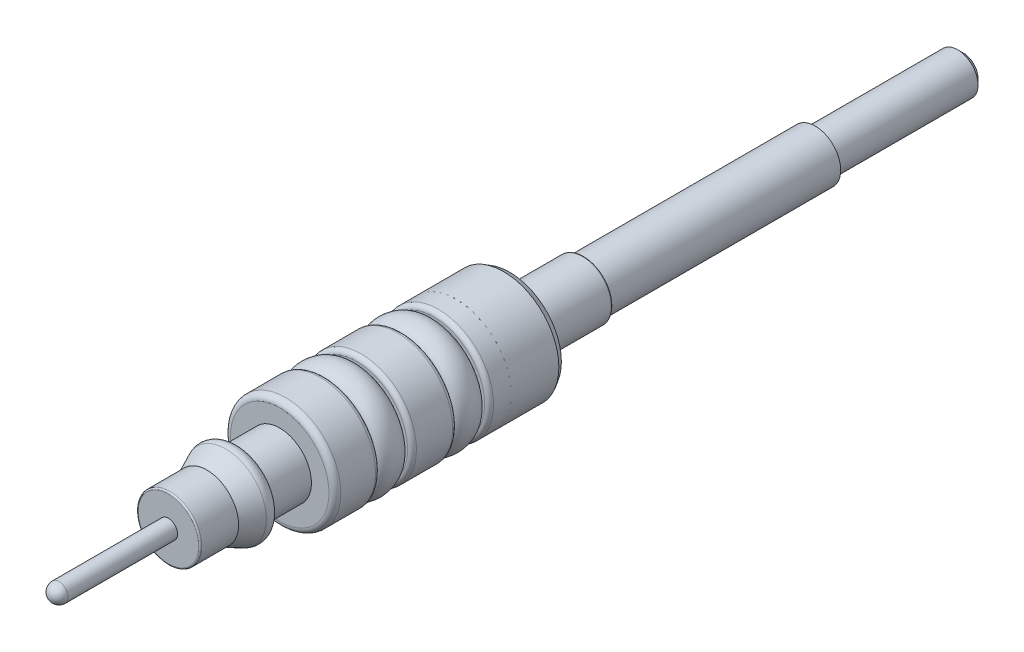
ISO-10303-21;
HEADER;
FILE_DESCRIPTION(('STEP AP214'),'2;1');
FILE_NAME('part.step','',(''),(''),'','','');
FILE_SCHEMA(('AUTOMOTIVE_DESIGN { 1 0 10303 214 1 1 1 1 }'));
ENDSEC;
DATA;
#1=APPLICATION_CONTEXT('core data for automotive mechanical design processes');
#2=APPLICATION_PROTOCOL_DEFINITION('international standard','automotive_design',2000,#1);
#3=PRODUCT_CONTEXT('',#1,'mechanical');
#4=PRODUCT('Part','Part','',(#3));
#5=PRODUCT_RELATED_PRODUCT_CATEGORY('part','',(#4));
#6=PRODUCT_DEFINITION_FORMATION('','',#4);
#7=PRODUCT_DEFINITION_CONTEXT('part definition',#1,'design');
#8=PRODUCT_DEFINITION('design','',#6,#7);
#9=PRODUCT_DEFINITION_SHAPE('','',#8);
#10=(LENGTH_UNIT() NAMED_UNIT(*) SI_UNIT(.MILLI.,.METRE.));
#11=(NAMED_UNIT(*) PLANE_ANGLE_UNIT() SI_UNIT($,.RADIAN.));
#12=(NAMED_UNIT(*) SI_UNIT($,.STERADIAN.) SOLID_ANGLE_UNIT());
#13=UNCERTAINTY_MEASURE_WITH_UNIT(LENGTH_MEASURE(1.E-05),#10,'distance_accuracy_value','');
#14=(GEOMETRIC_REPRESENTATION_CONTEXT(3) GLOBAL_UNCERTAINTY_ASSIGNED_CONTEXT((#13)) GLOBAL_UNIT_ASSIGNED_CONTEXT((#10,
#11,#12)) REPRESENTATION_CONTEXT('',''));
#15=CARTESIAN_POINT('',(0.,0.,0.));
#16=DIRECTION('',(0.,0.,1.));
#17=DIRECTION('',(1.,0.,0.));
#18=AXIS2_PLACEMENT_3D('',#15,#16,#17);
#19=CARTESIAN_POINT('',(0.,4.06918064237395,-21.3964123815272));
#20=DIRECTION('',(1.,0.,0.));
#21=DIRECTION('',(0.,0.,-1.));
#22=AXIS2_PLACEMENT_3D('',#19,#20,#21);
#23=ELLIPSE('',#22,1.21830797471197,0.690980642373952);
#24=CARTESIAN_POINT('',(0.,0.,-50.1249140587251));
#25=DIRECTION('',(0.,0.,-1.));
#26=AXIS1_PLACEMENT('',#24,#25);
#27=SURFACE_OF_REVOLUTION('',#23,#26);
#28=ADVANCED_FACE('F40',(),#27,.F.);
#29=CLOSED_SHELL('',(#28));
#30=MANIFOLD_SOLID_BREP('B2',#29);
#31=CARTESIAN_POINT('',(0.,4.06918064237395,-14.7924123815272));
#32=DIRECTION('',(1.,0.,0.));
#33=DIRECTION('',(0.,0.,-1.));
#34=AXIS2_PLACEMENT_3D('',#31,#32,#33);
#35=ELLIPSE('',#34,1.21830797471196,0.690980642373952);
#36=CARTESIAN_POINT('',(0.,0.,-50.1249140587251));
#37=DIRECTION('',(0.,0.,-1.));
#38=AXIS1_PLACEMENT('',#36,#37);
#39=SURFACE_OF_REVOLUTION('',#35,#38);
#40=ADVANCED_FACE('F62',(),#39,.F.);
#41=CLOSED_SHELL('',(#40));
#42=MANIFOLD_SOLID_BREP('B7',#41);
#43=CARTESIAN_POINT('',(0.,0.,0.));
#44=DIRECTION('',(0.,0.,1.));
#45=DIRECTION('',(1.,0.,0.));
#46=AXIS2_PLACEMENT_3D('',#43,#44,#45);
#47=CYLINDRICAL_SURFACE('',#46,3.175);
#48=CARTESIAN_POINT('',(0.,0.,-24.638));
#49=DIRECTION('',(0.,0.,1.));
#50=DIRECTION('',(1.,0.,0.));
#51=AXIS2_PLACEMENT_3D('',#48,#49,#50);
#52=CIRCLE('',#51,3.175);
#53=CARTESIAN_POINT('',(3.175,0.,-24.638));
#54=VERTEX_POINT('',#53);
#55=EDGE_CURVE('E98',#54,#54,#52,.T.);
#56=ORIENTED_EDGE('',*,*,#55,.F.);
#57=EDGE_LOOP('',(#56));
#58=FACE_BOUND('',#57,.T.);
#59=CARTESIAN_POINT('',(0.,0.,-24.6126));
#60=DIRECTION('',(0.,0.,1.));
#61=DIRECTION('',(1.,0.,0.));
#62=AXIS2_PLACEMENT_3D('',#59,#60,#61);
#63=CIRCLE('',#62,3.175);
#64=CARTESIAN_POINT('',(3.175,0.,-24.6126));
#65=VERTEX_POINT('',#64);
#66=EDGE_CURVE('E61',#65,#65,#63,.T.);
#67=ORIENTED_EDGE('',*,*,#66,.T.);
#68=EDGE_LOOP('',(#67));
#69=FACE_BOUND('',#68,.T.);
#70=ADVANCED_FACE('F84',(#58,#69),#47,.F.);
#71=CARTESIAN_POINT('',(0.,4.7244,-24.6126));
#72=DIRECTION('',(0.,0.,-1.));
#73=DIRECTION('',(-1.,0.,0.));
#74=AXIS2_PLACEMENT_3D('',#71,#72,#73);
#75=PLANE('',#74);
#76=ORIENTED_EDGE('',*,*,#66,.F.);
#77=EDGE_LOOP('',(#76));
#78=FACE_BOUND('',#77,.T.);
#79=CARTESIAN_POINT('',(0.,0.,-24.6126));
#80=DIRECTION('',(0.,0.,1.));
#81=DIRECTION('',(1.,0.,0.));
#82=AXIS2_PLACEMENT_3D('',#79,#80,#81);
#83=CIRCLE('',#82,4.7244);
#84=CARTESIAN_POINT('',(4.7244,0.,-24.6126));
#85=VERTEX_POINT('',#84);
#86=EDGE_CURVE('E90',#85,#85,#83,.T.);
#87=ORIENTED_EDGE('',*,*,#86,.T.);
#88=EDGE_LOOP('',(#87));
#89=FACE_BOUND('',#88,.T.);
#90=ADVANCED_FACE('F107',(#78,#89),#75,.F.);
#91=CARTESIAN_POINT('',(0.,0.,0.));
#92=DIRECTION('',(0.,0.,1.));
#93=DIRECTION('',(1.,0.,0.));
#94=AXIS2_PLACEMENT_3D('',#91,#92,#93);
#95=CYLINDRICAL_SURFACE('',#94,4.7244);
#96=ORIENTED_EDGE('',*,*,#86,.F.);
#97=EDGE_LOOP('',(#96));
#98=FACE_BOUND('',#97,.T.);
#99=CARTESIAN_POINT('',(0.,0.,-24.638));
#100=DIRECTION('',(0.,0.,1.));
#101=DIRECTION('',(1.,0.,0.));
#102=AXIS2_PLACEMENT_3D('',#99,#100,#101);
#103=CIRCLE('',#102,4.7244);
#104=CARTESIAN_POINT('',(4.7244,0.,-24.638));
#105=VERTEX_POINT('',#104);
#106=EDGE_CURVE('E94',#105,#105,#103,.T.);
#107=ORIENTED_EDGE('',*,*,#106,.T.);
#108=EDGE_LOOP('',(#107));
#109=FACE_BOUND('',#108,.T.);
#110=ADVANCED_FACE('F111',(#98,#109),#95,.T.);
#111=CARTESIAN_POINT('',(0.,4.7244,-24.638));
#112=DIRECTION('',(0.,0.,1.));
#113=DIRECTION('',(1.,0.,0.));
#114=AXIS2_PLACEMENT_3D('',#111,#112,#113);
#115=PLANE('',#114);
#116=ORIENTED_EDGE('',*,*,#106,.F.);
#117=EDGE_LOOP('',(#116));
#118=FACE_BOUND('',#117,.T.);
#119=ORIENTED_EDGE('',*,*,#55,.T.);
#120=EDGE_LOOP('',(#119));
#121=FACE_BOUND('',#120,.T.);
#122=ADVANCED_FACE('F104',(#118,#121),#115,.F.);
#123=CLOSED_SHELL('',(#70,#90,#110,#122));
#124=MANIFOLD_SOLID_BREP('B35',#123);
#125=CARTESIAN_POINT('',(0.,0.7874,-9.52500000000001));
#126=DIRECTION('',(0.,0.,-1.));
#127=DIRECTION('',(-1.,0.,0.));
#128=AXIS2_PLACEMENT_3D('',#125,#126,#127);
#129=PLANE('',#128);
#130=CARTESIAN_POINT('',(0.,0.,-9.52500000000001));
#131=DIRECTION('',(0.,0.,-1.));
#132=DIRECTION('',(-1.,0.,0.));
#133=AXIS2_PLACEMENT_3D('',#130,#131,#132);
#134=CIRCLE('',#133,0.7874);
#135=CARTESIAN_POINT('',(-0.7874,0.,-9.52500000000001));
#136=VERTEX_POINT('',#135);
#137=EDGE_CURVE('E83',#136,#136,#134,.T.);
#138=ORIENTED_EDGE('',*,*,#137,.T.);
#139=EDGE_LOOP('',(#138));
#140=FACE_BOUND('',#139,.T.);
#141=ADVANCED_FACE('F154',(#140),#129,.T.);
#142=CARTESIAN_POINT('',(0.,0.,-7.2387781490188));
#143=DIRECTION('',(0.,0.,-1.));
#144=DIRECTION('',(-1.,0.,0.));
#145=AXIS2_PLACEMENT_3D('',#142,#143,#144);
#146=CYLINDRICAL_SURFACE('',#145,0.787399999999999);
#147=CARTESIAN_POINT('',(0.,0.,9.37259999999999));
#148=DIRECTION('',(0.,0.,-1.));
#149=DIRECTION('',(-1.,0.,0.));
#150=AXIS2_PLACEMENT_3D('',#147,#148,#149);
#151=CIRCLE('',#150,0.787399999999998);
#152=CARTESIAN_POINT('',(-0.787399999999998,0.,9.37259999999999));
#153=VERTEX_POINT('',#152);
#154=EDGE_CURVE('E160',#153,#153,#151,.T.);
#155=ORIENTED_EDGE('',*,*,#154,.T.);
#156=EDGE_LOOP('',(#155));
#157=FACE_BOUND('',#156,.T.);
#158=ORIENTED_EDGE('',*,*,#137,.F.);
#159=EDGE_LOOP('',(#158));
#160=FACE_BOUND('',#159,.T.);
#161=ADVANCED_FACE('F166',(#157,#160),#146,.T.);
#162=CARTESIAN_POINT('',(0.,0.,9.37259999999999));
#163=DIRECTION('',(0.,0.,-1.));
#164=DIRECTION('',(0.,1.,0.));
#165=AXIS2_PLACEMENT_3D('',#162,#163,#164);
#166=SPHERICAL_SURFACE('',#165,0.7874);
#167=ORIENTED_EDGE('',*,*,#154,.F.);
#168=EDGE_LOOP('',(#167));
#169=FACE_BOUND('',#168,.T.);
#170=ADVANCED_FACE('F169',(#169),#166,.T.);
#171=CLOSED_SHELL('',(#141,#161,#170));
#172=MANIFOLD_SOLID_BREP('B56',#171);
#173=CARTESIAN_POINT('',(0.,1.74625,-68.072));
#174=DIRECTION('',(0.,0.,1.));
#175=DIRECTION('',(1.,0.,0.));
#176=AXIS2_PLACEMENT_3D('',#173,#174,#175);
#177=PLANE('',#176);
#178=CARTESIAN_POINT('',(0.,0.,-68.072));
#179=DIRECTION('',(0.,0.,1.));
#180=DIRECTION('',(1.,0.,0.));
#181=AXIS2_PLACEMENT_3D('',#178,#179,#180);
#182=CIRCLE('',#181,1.23825);
#183=CARTESIAN_POINT('',(1.23825,0.,-68.072));
#184=VERTEX_POINT('',#183);
#185=EDGE_CURVE('E153',#184,#184,#182,.F.);
#186=ORIENTED_EDGE('',*,*,#185,.T.);
#187=EDGE_LOOP('',(#186));
#188=FACE_BOUND('',#187,.T.);
#189=ADVANCED_FACE('F203',(#188),#177,.F.);
#190=CARTESIAN_POINT('',(0.,1.3335,-35.56));
#191=DIRECTION('',(0.,0.,-1.));
#192=DIRECTION('',(-1.,0.,0.));
#193=AXIS2_PLACEMENT_3D('',#190,#191,#192);
#194=PLANE('',#193);
#195=CARTESIAN_POINT('',(0.,0.,-35.56));
#196=DIRECTION('',(0.,0.,1.));
#197=DIRECTION('',(1.,0.,0.));
#198=AXIS2_PLACEMENT_3D('',#195,#196,#197);
#199=CIRCLE('',#198,1.3335);
#200=CARTESIAN_POINT('',(1.3335,0.,-35.56));
#201=VERTEX_POINT('',#200);
#202=EDGE_CURVE('E213',#201,#201,#199,.T.);
#203=ORIENTED_EDGE('',*,*,#202,.T.);
#204=EDGE_LOOP('',(#203));
#205=FACE_BOUND('',#204,.T.);
#206=ADVANCED_FACE('F242',(#205),#194,.F.);
#207=CARTESIAN_POINT('',(0.,0.,6.76281178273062));
#208=DIRECTION('',(0.,0.,1.));
#209=DIRECTION('',(1.,0.,0.));
#210=AXIS2_PLACEMENT_3D('',#207,#208,#209);
#211=CYLINDRICAL_SURFACE('',#210,1.3335);
#212=ORIENTED_EDGE('',*,*,#202,.F.);
#213=EDGE_LOOP('',(#212));
#214=FACE_BOUND('',#213,.T.);
#215=CARTESIAN_POINT('',(0.,0.,-41.91));
#216=DIRECTION('',(0.,0.,1.));
#217=DIRECTION('',(1.,0.,0.));
#218=AXIS2_PLACEMENT_3D('',#215,#216,#217);
#219=CIRCLE('',#218,1.3335);
#220=CARTESIAN_POINT('',(1.3335,0.,-41.91));
#221=VERTEX_POINT('',#220);
#222=EDGE_CURVE('E217',#221,#221,#219,.T.);
#223=ORIENTED_EDGE('',*,*,#222,.T.);
#224=EDGE_LOOP('',(#223));
#225=FACE_BOUND('',#224,.T.);
#226=ADVANCED_FACE('F238',(#214,#225),#211,.T.);
#227=CARTESIAN_POINT('',(0.,1.74625,-41.91));
#228=DIRECTION('',(0.,0.,-1.));
#229=DIRECTION('',(-1.,0.,0.));
#230=AXIS2_PLACEMENT_3D('',#227,#228,#229);
#231=PLANE('',#230);
#232=ORIENTED_EDGE('',*,*,#222,.F.);
#233=EDGE_LOOP('',(#232));
#234=FACE_BOUND('',#233,.T.);
#235=CARTESIAN_POINT('',(0.,0.,-41.91));
#236=DIRECTION('',(0.,0.,1.));
#237=DIRECTION('',(1.,0.,0.));
#238=AXIS2_PLACEMENT_3D('',#235,#236,#237);
#239=CIRCLE('',#238,1.74625);
#240=CARTESIAN_POINT('',(1.74625,0.,-41.91));
#241=VERTEX_POINT('',#240);
#242=EDGE_CURVE('E222',#241,#241,#239,.T.);
#243=ORIENTED_EDGE('',*,*,#242,.T.);
#244=EDGE_LOOP('',(#243));
#245=FACE_BOUND('',#244,.T.);
#246=ADVANCED_FACE('F226',(#234,#245),#231,.F.);
#247=CARTESIAN_POINT('',(0.,0.,6.76281178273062));
#248=DIRECTION('',(0.,0.,1.));
#249=DIRECTION('',(1.,0.,0.));
#250=AXIS2_PLACEMENT_3D('',#247,#248,#249);
#251=CYLINDRICAL_SURFACE('',#250,1.74625);
#252=CARTESIAN_POINT('',(0.,0.,-67.564));
#253=DIRECTION('',(0.,0.,1.));
#254=DIRECTION('',(1.,0.,0.));
#255=AXIS2_PLACEMENT_3D('',#252,#253,#254);
#256=CIRCLE('',#255,1.74625);
#257=CARTESIAN_POINT('',(1.74625,0.,-67.564));
#258=VERTEX_POINT('',#257);
#259=EDGE_CURVE('E209',#258,#258,#256,.T.);
#260=ORIENTED_EDGE('',*,*,#259,.T.);
#261=EDGE_LOOP('',(#260));
#262=FACE_BOUND('',#261,.T.);
#263=ORIENTED_EDGE('',*,*,#242,.F.);
#264=EDGE_LOOP('',(#263));
#265=FACE_BOUND('',#264,.T.);
#266=ADVANCED_FACE('F228',(#262,#265),#251,.T.);
#267=CARTESIAN_POINT('',(0.,0.,-67.564));
#268=DIRECTION('',(0.,0.,1.));
#269=DIRECTION('',(1.,0.,0.));
#270=AXIS2_PLACEMENT_3D('',#267,#268,#269);
#271=CONICAL_SURFACE('',#270,1.74625,0.785398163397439);
#272=ORIENTED_EDGE('',*,*,#185,.F.);
#273=EDGE_LOOP('',(#272));
#274=FACE_BOUND('',#273,.T.);
#275=ORIENTED_EDGE('',*,*,#259,.F.);
#276=EDGE_LOOP('',(#275));
#277=FACE_BOUND('',#276,.T.);
#278=ADVANCED_FACE('F230',(#274,#277),#271,.T.);
#279=CLOSED_SHELL('',(#189,#206,#226,#246,#266,#278));
#280=MANIFOLD_SOLID_BREP('B78',#279);
#281=CARTESIAN_POINT('',(0.,1.7526,-35.56));
#282=DIRECTION('',(0.,0.,-1.));
#283=DIRECTION('',(-1.,0.,0.));
#284=AXIS2_PLACEMENT_3D('',#281,#282,#283);
#285=PLANE('',#284);
#286=CARTESIAN_POINT('',(0.,0.,-35.56));
#287=DIRECTION('',(0.,0.,1.));
#288=DIRECTION('',(1.,0.,0.));
#289=AXIS2_PLACEMENT_3D('',#286,#287,#288);
#290=CIRCLE('',#289,1.7526);
#291=CARTESIAN_POINT('',(1.7526,0.,-35.56));
#292=VERTEX_POINT('',#291);
#293=EDGE_CURVE('E312',#292,#292,#290,.T.);
#294=ORIENTED_EDGE('',*,*,#293,.F.);
#295=EDGE_LOOP('',(#294));
#296=FACE_BOUND('',#295,.T.);
#297=CARTESIAN_POINT('',(0.,0.,-35.56));
#298=DIRECTION('',(0.,0.,1.));
#299=DIRECTION('',(1.,0.,0.));
#300=AXIS2_PLACEMENT_3D('',#297,#298,#299);
#301=CIRCLE('',#300,2.1844);
#302=CARTESIAN_POINT('',(2.1844,0.,-35.56));
#303=VERTEX_POINT('',#302);
#304=EDGE_CURVE('E202',#303,#303,#301,.T.);
#305=ORIENTED_EDGE('',*,*,#304,.T.);
#306=EDGE_LOOP('',(#305));
#307=FACE_BOUND('',#306,.T.);
#308=ADVANCED_FACE('F298',(#296,#307),#285,.F.);
#309=CARTESIAN_POINT('',(0.,0.,2.80050758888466));
#310=DIRECTION('',(0.,0.,1.));
#311=DIRECTION('',(1.,0.,0.));
#312=AXIS2_PLACEMENT_3D('',#309,#310,#311);
#313=CYLINDRICAL_SURFACE('',#312,2.1844);
#314=ORIENTED_EDGE('',*,*,#304,.F.);
#315=EDGE_LOOP('',(#314));
#316=FACE_BOUND('',#315,.T.);
#317=CARTESIAN_POINT('',(0.,0.,-55.372));
#318=DIRECTION('',(0.,0.,1.));
#319=DIRECTION('',(1.,0.,0.));
#320=AXIS2_PLACEMENT_3D('',#317,#318,#319);
#321=CIRCLE('',#320,2.1844);
#322=CARTESIAN_POINT('',(2.1844,0.,-55.372));
#323=VERTEX_POINT('',#322);
#324=EDGE_CURVE('E304',#323,#323,#321,.T.);
#325=ORIENTED_EDGE('',*,*,#324,.T.);
#326=EDGE_LOOP('',(#325));
#327=FACE_BOUND('',#326,.T.);
#328=ADVANCED_FACE('F321',(#316,#327),#313,.T.);
#329=CARTESIAN_POINT('',(0.,2.1844,-55.372));
#330=DIRECTION('',(0.,0.,1.));
#331=DIRECTION('',(1.,0.,0.));
#332=AXIS2_PLACEMENT_3D('',#329,#330,#331);
#333=PLANE('',#332);
#334=ORIENTED_EDGE('',*,*,#324,.F.);
#335=EDGE_LOOP('',(#334));
#336=FACE_BOUND('',#335,.T.);
#337=CARTESIAN_POINT('',(0.,0.,-55.372));
#338=DIRECTION('',(0.,0.,1.));
#339=DIRECTION('',(1.,0.,0.));
#340=AXIS2_PLACEMENT_3D('',#337,#338,#339);
#341=CIRCLE('',#340,1.7526);
#342=CARTESIAN_POINT('',(1.7526,0.,-55.372));
#343=VERTEX_POINT('',#342);
#344=EDGE_CURVE('E308',#343,#343,#341,.T.);
#345=ORIENTED_EDGE('',*,*,#344,.T.);
#346=EDGE_LOOP('',(#345));
#347=FACE_BOUND('',#346,.T.);
#348=ADVANCED_FACE('F325',(#336,#347),#333,.F.);
#349=CARTESIAN_POINT('',(0.,0.,2.80050758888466));
#350=DIRECTION('',(0.,0.,1.));
#351=DIRECTION('',(1.,0.,0.));
#352=AXIS2_PLACEMENT_3D('',#349,#350,#351);
#353=CYLINDRICAL_SURFACE('',#352,1.7526);
#354=ORIENTED_EDGE('',*,*,#344,.F.);
#355=EDGE_LOOP('',(#354));
#356=FACE_BOUND('',#355,.T.);
#357=ORIENTED_EDGE('',*,*,#293,.T.);
#358=EDGE_LOOP('',(#357));
#359=FACE_BOUND('',#358,.T.);
#360=ADVANCED_FACE('F318',(#356,#359),#353,.F.);
#361=CLOSED_SHELL('',(#308,#328,#348,#360));
#362=MANIFOLD_SOLID_BREP('B148',#361);
#363=CARTESIAN_POINT('',(0.,0.,84.1236956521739));
#364=DIRECTION('',(0.,0.,1.));
#365=DIRECTION('',(1.,0.,0.));
#366=AXIS2_PLACEMENT_3D('',#363,#364,#365);
#367=CYLINDRICAL_SURFACE('',#366,2.7178);
#368=CARTESIAN_POINT('',(0.,0.,-5.9944));
#369=DIRECTION('',(0.,0.,1.));
#370=DIRECTION('',(1.,0.,0.));
#371=AXIS2_PLACEMENT_3D('',#368,#369,#370);
#372=CIRCLE('',#371,2.7178);
#373=CARTESIAN_POINT('',(2.7178,0.,-5.9944));
#374=VERTEX_POINT('',#373);
#375=EDGE_CURVE('E442',#374,#374,#372,.T.);
#376=ORIENTED_EDGE('',*,*,#375,.F.);
#377=EDGE_LOOP('',(#376));
#378=FACE_BOUND('',#377,.T.);
#379=CARTESIAN_POINT('',(0.,0.,-9.52500000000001));
#380=DIRECTION('',(0.,0.,-1.));
#381=DIRECTION('',(-1.,0.,0.));
#382=AXIS2_PLACEMENT_3D('',#379,#380,#381);
#383=CIRCLE('',#382,2.7178);
#384=CARTESIAN_POINT('',(-2.7178,0.,-9.52500000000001));
#385=VERTEX_POINT('',#384);
#386=EDGE_CURVE('E445',#385,#385,#383,.T.);
#387=ORIENTED_EDGE('',*,*,#386,.F.);
#388=EDGE_LOOP('',(#387));
#389=FACE_BOUND('',#388,.T.);
#390=ADVANCED_FACE('F360',(#378,#389),#367,.T.);
#391=CARTESIAN_POINT('',(0.,0.,0.));
#392=DIRECTION('',(0.,0.,-1.));
#393=DIRECTION('',(-1.,0.,0.));
#394=AXIS2_PLACEMENT_3D('',#391,#392,#393);
#395=PLANE('',#394);
#396=CARTESIAN_POINT('',(0.,0.,0.));
#397=DIRECTION('',(0.,0.,-1.));
#398=DIRECTION('',(-1.,0.,0.));
#399=AXIS2_PLACEMENT_3D('',#396,#397,#398);
#400=CIRCLE('',#399,2.5908);
#401=CARTESIAN_POINT('',(-2.5908,0.,0.));
#402=VERTEX_POINT('',#401);
#403=EDGE_CURVE('E366',#402,#402,#400,.F.);
#404=ORIENTED_EDGE('',*,*,#403,.T.);
#405=EDGE_LOOP('',(#404));
#406=FACE_BOUND('',#405,.T.);
#407=CARTESIAN_POINT('',(0.,0.,0.));
#408=DIRECTION('',(0.,0.,1.));
#409=DIRECTION('',(1.,0.,0.));
#410=AXIS2_PLACEMENT_3D('',#407,#408,#409);
#411=CIRCLE('',#410,0.7874);
#412=CARTESIAN_POINT('',(0.7874,0.,0.));
#413=VERTEX_POINT('',#412);
#414=EDGE_CURVE('E472',#413,#413,#411,.T.);
#415=ORIENTED_EDGE('',*,*,#414,.F.);
#416=EDGE_LOOP('',(#415));
#417=FACE_BOUND('',#416,.T.);
#418=ADVANCED_FACE('F478',(#406,#417),#395,.F.);
#419=CARTESIAN_POINT('',(0.,0.,84.1236956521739));
#420=DIRECTION('',(0.,0.,1.));
#421=DIRECTION('',(1.,0.,0.));
#422=AXIS2_PLACEMENT_3D('',#419,#420,#421);
#423=CYLINDRICAL_SURFACE('',#422,2.7178);
#424=CARTESIAN_POINT('',(0.,0.,-0.127000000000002));
#425=DIRECTION('',(0.,0.,-1.));
#426=DIRECTION('',(-1.,0.,0.));
#427=AXIS2_PLACEMENT_3D('',#424,#425,#426);
#428=CIRCLE('',#427,2.7178);
#429=CARTESIAN_POINT('',(-2.7178,0.,-0.127000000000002));
#430=VERTEX_POINT('',#429);
#431=EDGE_CURVE('E297',#430,#430,#428,.T.);
#432=ORIENTED_EDGE('',*,*,#431,.T.);
#433=EDGE_LOOP('',(#432));
#434=FACE_BOUND('',#433,.T.);
#435=CARTESIAN_POINT('',(0.,0.,-3.29317820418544));
#436=DIRECTION('',(0.,0.,1.));
#437=DIRECTION('',(1.,0.,0.));
#438=AXIS2_PLACEMENT_3D('',#435,#436,#437);
#439=CIRCLE('',#438,2.7178);
#440=CARTESIAN_POINT('',(2.7178,0.,-3.29317820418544));
#441=VERTEX_POINT('',#440);
#442=EDGE_CURVE('E433',#441,#441,#439,.T.);
#443=ORIENTED_EDGE('',*,*,#442,.T.);
#444=EDGE_LOOP('',(#443));
#445=FACE_BOUND('',#444,.T.);
#446=ADVANCED_FACE('F480',(#434,#445),#423,.T.);
#447=CARTESIAN_POINT('',(0.,0.,-4.91036488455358));
#448=DIRECTION('',(0.,0.,-1.));
#449=DIRECTION('',(-1.,0.,0.));
#450=AXIS2_PLACEMENT_3D('',#447,#448,#449);
#451=CONICAL_SURFACE('',#450,3.47190653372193,0.436332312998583);
#452=ORIENTED_EDGE('',*,*,#442,.F.);
#453=EDGE_LOOP('',(#452));
#454=FACE_BOUND('',#453,.T.);
#455=CARTESIAN_POINT('',(0.,0.,-4.91036488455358));
#456=DIRECTION('',(0.,0.,1.));
#457=DIRECTION('',(1.,0.,0.));
#458=AXIS2_PLACEMENT_3D('',#455,#456,#457);
#459=CIRCLE('',#458,3.47190653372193);
#460=CARTESIAN_POINT('',(3.47190653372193,0.,-4.91036488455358));
#461=VERTEX_POINT('',#460);
#462=EDGE_CURVE('E436',#461,#461,#459,.T.);
#463=ORIENTED_EDGE('',*,*,#462,.T.);
#464=EDGE_LOOP('',(#463));
#465=FACE_BOUND('',#464,.T.);
#466=ADVANCED_FACE('F485',(#454,#465),#451,.T.);
#467=CARTESIAN_POINT('',(0.,0.,-5.2324));
#468=DIRECTION('',(0.,0.,1.));
#469=DIRECTION('',(1.,0.,0.));
#470=AXIS2_PLACEMENT_3D('',#467,#468,#469);
#471=TOROIDAL_SURFACE('',#470,2.7813,0.762);
#472=ORIENTED_EDGE('',*,*,#462,.F.);
#473=EDGE_LOOP('',(#472));
#474=FACE_BOUND('',#473,.T.);
#475=CARTESIAN_POINT('',(0.,0.,-5.9944));
#476=DIRECTION('',(0.,0.,1.));
#477=DIRECTION('',(1.,0.,0.));
#478=AXIS2_PLACEMENT_3D('',#475,#476,#477);
#479=CIRCLE('',#478,2.7813);
#480=CARTESIAN_POINT('',(2.7813,0.,-5.9944));
#481=VERTEX_POINT('',#480);
#482=EDGE_CURVE('E439',#481,#481,#479,.T.);
#483=ORIENTED_EDGE('',*,*,#482,.T.);
#484=EDGE_LOOP('',(#483));
#485=FACE_BOUND('',#484,.T.);
#486=ADVANCED_FACE('F491',(#474,#485),#471,.T.);
#487=CARTESIAN_POINT('',(0.,2.7178,-5.9944));
#488=DIRECTION('',(0.,0.,1.));
#489=DIRECTION('',(1.,0.,0.));
#490=AXIS2_PLACEMENT_3D('',#487,#488,#489);
#491=PLANE('',#490);
#492=ORIENTED_EDGE('',*,*,#482,.F.);
#493=EDGE_LOOP('',(#492));
#494=FACE_BOUND('',#493,.T.);
#495=ORIENTED_EDGE('',*,*,#375,.T.);
#496=EDGE_LOOP('',(#495));
#497=FACE_BOUND('',#496,.T.);
#498=ADVANCED_FACE('F495',(#494,#497),#491,.F.);
#499=CARTESIAN_POINT('',(0.,0.,-9.52500000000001));
#500=DIRECTION('',(0.,0.,-1.));
#501=DIRECTION('',(-1.,0.,0.));
#502=AXIS2_PLACEMENT_3D('',#499,#500,#501);
#503=PLANE('',#502);
#504=CARTESIAN_POINT('',(0.,0.,-9.52500000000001));
#505=DIRECTION('',(0.,0.,-1.));
#506=DIRECTION('',(-1.,0.,0.));
#507=AXIS2_PLACEMENT_3D('',#504,#505,#506);
#508=CIRCLE('',#507,4.2164);
#509=CARTESIAN_POINT('',(-4.2164,0.,-9.52500000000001));
#510=VERTEX_POINT('',#509);
#511=EDGE_CURVE('E430',#510,#510,#508,.F.);
#512=ORIENTED_EDGE('',*,*,#511,.T.);
#513=EDGE_LOOP('',(#512));
#514=FACE_BOUND('',#513,.T.);
#515=ORIENTED_EDGE('',*,*,#386,.T.);
#516=EDGE_LOOP('',(#515));
#517=FACE_BOUND('',#516,.T.);
#518=ADVANCED_FACE('F499',(#514,#517),#503,.F.);
#519=CARTESIAN_POINT('',(0.,0.,21.6081705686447));
#520=DIRECTION('',(0.,0.,1.));
#521=DIRECTION('',(1.,0.,0.));
#522=AXIS2_PLACEMENT_3D('',#519,#520,#521);
#523=CYLINDRICAL_SURFACE('',#522,1.7526);
#524=CARTESIAN_POINT('',(0.,0.,-35.56));
#525=DIRECTION('',(0.,0.,1.));
#526=DIRECTION('',(1.,0.,0.));
#527=AXIS2_PLACEMENT_3D('',#524,#525,#526);
#528=CIRCLE('',#527,1.7526);
#529=CARTESIAN_POINT('',(1.7526,0.,-35.56));
#530=VERTEX_POINT('',#529);
#531=EDGE_CURVE('E466',#530,#530,#528,.T.);
#532=ORIENTED_EDGE('',*,*,#531,.F.);
#533=EDGE_LOOP('',(#532));
#534=FACE_BOUND('',#533,.T.);
#535=CARTESIAN_POINT('',(0.,0.,-41.91));
#536=DIRECTION('',(0.,0.,1.));
#537=DIRECTION('',(1.,0.,0.));
#538=AXIS2_PLACEMENT_3D('',#535,#536,#537);
#539=CIRCLE('',#538,1.7526);
#540=CARTESIAN_POINT('',(1.7526,0.,-41.91));
#541=VERTEX_POINT('',#540);
#542=EDGE_CURVE('E448',#541,#541,#539,.T.);
#543=ORIENTED_EDGE('',*,*,#542,.T.);
#544=EDGE_LOOP('',(#543));
#545=FACE_BOUND('',#544,.T.);
#546=ADVANCED_FACE('F501',(#534,#545),#523,.T.);
#547=CARTESIAN_POINT('',(0.,1.7526,-41.91));
#548=DIRECTION('',(0.,0.,1.));
#549=DIRECTION('',(1.,0.,0.));
#550=AXIS2_PLACEMENT_3D('',#547,#548,#549);
#551=PLANE('',#550);
#552=ORIENTED_EDGE('',*,*,#542,.F.);
#553=EDGE_LOOP('',(#552));
#554=FACE_BOUND('',#553,.T.);
#555=CARTESIAN_POINT('',(0.,0.,-41.91));
#556=DIRECTION('',(0.,0.,1.));
#557=DIRECTION('',(1.,0.,0.));
#558=AXIS2_PLACEMENT_3D('',#555,#556,#557);
#559=CIRCLE('',#558,1.3335);
#560=CARTESIAN_POINT('',(1.3335,0.,-41.91));
#561=VERTEX_POINT('',#560);
#562=EDGE_CURVE('E451',#561,#561,#559,.T.);
#563=ORIENTED_EDGE('',*,*,#562,.T.);
#564=EDGE_LOOP('',(#563));
#565=FACE_BOUND('',#564,.T.);
#566=ADVANCED_FACE('F504',(#554,#565),#551,.F.);
#567=CARTESIAN_POINT('',(0.,0.,21.6081705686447));
#568=DIRECTION('',(0.,0.,1.));
#569=DIRECTION('',(1.,0.,0.));
#570=AXIS2_PLACEMENT_3D('',#567,#568,#569);
#571=CYLINDRICAL_SURFACE('',#570,1.3335);
#572=ORIENTED_EDGE('',*,*,#562,.F.);
#573=EDGE_LOOP('',(#572));
#574=FACE_BOUND('',#573,.T.);
#575=CARTESIAN_POINT('',(0.,0.,-35.56));
#576=DIRECTION('',(0.,0.,1.));
#577=DIRECTION('',(1.,0.,0.));
#578=AXIS2_PLACEMENT_3D('',#575,#576,#577);
#579=CIRCLE('',#578,1.3335);
#580=CARTESIAN_POINT('',(1.3335,0.,-35.56));
#581=VERTEX_POINT('',#580);
#582=EDGE_CURVE('E454',#581,#581,#579,.T.);
#583=ORIENTED_EDGE('',*,*,#582,.T.);
#584=EDGE_LOOP('',(#583));
#585=FACE_BOUND('',#584,.T.);
#586=ADVANCED_FACE('F508',(#574,#585),#571,.F.);
#587=CARTESIAN_POINT('',(0.,1.3335,-35.56));
#588=DIRECTION('',(0.,0.,1.));
#589=DIRECTION('',(1.,0.,0.));
#590=AXIS2_PLACEMENT_3D('',#587,#588,#589);
#591=PLANE('',#590);
#592=ORIENTED_EDGE('',*,*,#582,.F.);
#593=EDGE_LOOP('',(#592));
#594=FACE_BOUND('',#593,.T.);
#595=ADVANCED_FACE('F512',(#594),#591,.F.);
#596=CARTESIAN_POINT('',(0.,0.,21.6081705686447));
#597=DIRECTION('',(0.,0.,1.));
#598=DIRECTION('',(1.,0.,0.));
#599=AXIS2_PLACEMENT_3D('',#596,#597,#598);
#600=CYLINDRICAL_SURFACE('',#599,4.7244);
#601=CARTESIAN_POINT('',(0.,0.,-13.0048));
#602=DIRECTION('',(0.,0.,1.));
#603=DIRECTION('',(1.,0.,0.));
#604=AXIS2_PLACEMENT_3D('',#601,#602,#603);
#605=CIRCLE('',#604,4.7244);
#606=CARTESIAN_POINT('',(4.7244,0.,-13.0048));
#607=VERTEX_POINT('',#606);
#608=EDGE_CURVE('E406',#607,#607,#605,.T.);
#609=ORIENTED_EDGE('',*,*,#608,.T.);
#610=EDGE_LOOP('',(#609));
#611=FACE_BOUND('',#610,.T.);
#612=CARTESIAN_POINT('',(0.,0.,-10.033));
#613=DIRECTION('',(0.,0.,-1.));
#614=DIRECTION('',(-1.,0.,0.));
#615=AXIS2_PLACEMENT_3D('',#612,#613,#614);
#616=CIRCLE('',#615,4.7244);
#617=CARTESIAN_POINT('',(-4.7244,0.,-10.033));
#618=VERTEX_POINT('',#617);
#619=EDGE_CURVE('E427',#618,#618,#616,.T.);
#620=ORIENTED_EDGE('',*,*,#619,.T.);
#621=EDGE_LOOP('',(#620));
#622=FACE_BOUND('',#621,.T.);
#623=ADVANCED_FACE('F516',(#611,#622),#600,.T.);
#624=CARTESIAN_POINT('',(0.,4.7244,-13.3858));
#625=DIRECTION('',(0.,0.,1.));
#626=DIRECTION('',(1.,0.,0.));
#627=AXIS2_PLACEMENT_3D('',#624,#625,#626);
#628=PLANE('',#627);
#629=CARTESIAN_POINT('',(0.,0.,-13.3858));
#630=DIRECTION('',(0.,0.,1.));
#631=DIRECTION('',(1.,0.,0.));
#632=AXIS2_PLACEMENT_3D('',#629,#630,#631);
#633=CIRCLE('',#632,3.8862);
#634=CARTESIAN_POINT('',(3.8862,0.,-13.3858));
#635=VERTEX_POINT('',#634);
#636=EDGE_CURVE('E391',#635,#635,#633,.T.);
#637=ORIENTED_EDGE('',*,*,#636,.T.);
#638=EDGE_LOOP('',(#637));
#639=FACE_BOUND('',#638,.T.);
#640=CARTESIAN_POINT('',(0.,0.,-13.3858));
#641=DIRECTION('',(0.,0.,1.));
#642=DIRECTION('',(1.,0.,0.));
#643=AXIS2_PLACEMENT_3D('',#640,#641,#642);
#644=CIRCLE('',#643,4.3434);
#645=CARTESIAN_POINT('',(4.3434,0.,-13.3858));
#646=VERTEX_POINT('',#645);
#647=EDGE_CURVE('E403',#646,#646,#644,.F.);
#648=ORIENTED_EDGE('',*,*,#647,.T.);
#649=EDGE_LOOP('',(#648));
#650=FACE_BOUND('',#649,.T.);
#651=ADVANCED_FACE('F523',(#639,#650),#628,.F.);
#652=CARTESIAN_POINT('',(0.,0.,21.6081705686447));
#653=DIRECTION('',(0.,0.,1.));
#654=DIRECTION('',(1.,0.,0.));
#655=AXIS2_PLACEMENT_3D('',#652,#653,#654);
#656=CYLINDRICAL_SURFACE('',#655,3.3782);
#657=CARTESIAN_POINT('',(0.,0.,-15.621));
#658=DIRECTION('',(0.,0.,-1.));
#659=DIRECTION('',(-1.,0.,0.));
#660=AXIS2_PLACEMENT_3D('',#657,#658,#659);
#661=CIRCLE('',#660,3.3782);
#662=CARTESIAN_POINT('',(-3.3782,0.,-15.621));
#663=VERTEX_POINT('',#662);
#664=EDGE_CURVE('E397',#663,#663,#661,.F.);
#665=ORIENTED_EDGE('',*,*,#664,.T.);
#666=EDGE_LOOP('',(#665));
#667=FACE_BOUND('',#666,.T.);
#668=CARTESIAN_POINT('',(0.,0.,-13.8938));
#669=DIRECTION('',(0.,0.,1.));
#670=DIRECTION('',(1.,0.,0.));
#671=AXIS2_PLACEMENT_3D('',#668,#669,#670);
#672=CIRCLE('',#671,3.3782);
#673=CARTESIAN_POINT('',(3.3782,0.,-13.8938));
#674=VERTEX_POINT('',#673);
#675=EDGE_CURVE('E400',#674,#674,#672,.F.);
#676=ORIENTED_EDGE('',*,*,#675,.T.);
#677=EDGE_LOOP('',(#676));
#678=FACE_BOUND('',#677,.T.);
#679=ADVANCED_FACE('F527',(#667,#678),#656,.T.);
#680=CARTESIAN_POINT('',(0.,3.3782,-16.129));
#681=DIRECTION('',(0.,0.,-1.));
#682=DIRECTION('',(-1.,0.,0.));
#683=AXIS2_PLACEMENT_3D('',#680,#681,#682);
#684=PLANE('',#683);
#685=CARTESIAN_POINT('',(0.,0.,-16.129));
#686=DIRECTION('',(0.,0.,-1.));
#687=DIRECTION('',(-1.,0.,0.));
#688=AXIS2_PLACEMENT_3D('',#685,#686,#687);
#689=CIRCLE('',#688,3.8862);
#690=CARTESIAN_POINT('',(-3.8862,0.,-16.129));
#691=VERTEX_POINT('',#690);
#692=EDGE_CURVE('E394',#691,#691,#689,.T.);
#693=ORIENTED_EDGE('',*,*,#692,.T.);
#694=EDGE_LOOP('',(#693));
#695=FACE_BOUND('',#694,.T.);
#696=CARTESIAN_POINT('',(0.,0.,-16.129));
#697=DIRECTION('',(0.,0.,-1.));
#698=DIRECTION('',(-1.,0.,0.));
#699=AXIS2_PLACEMENT_3D('',#696,#697,#698);
#700=CIRCLE('',#699,4.3434);
#701=CARTESIAN_POINT('',(-4.3434,0.,-16.129));
#702=VERTEX_POINT('',#701);
#703=EDGE_CURVE('E409',#702,#702,#700,.F.);
#704=ORIENTED_EDGE('',*,*,#703,.T.);
#705=EDGE_LOOP('',(#704));
#706=FACE_BOUND('',#705,.T.);
#707=ADVANCED_FACE('F531',(#695,#706),#684,.F.);
#708=CARTESIAN_POINT('',(0.,0.,21.6081705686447));
#709=DIRECTION('',(0.,0.,1.));
#710=DIRECTION('',(1.,0.,0.));
#711=AXIS2_PLACEMENT_3D('',#708,#709,#710);
#712=CYLINDRICAL_SURFACE('',#711,4.7244);
#713=CARTESIAN_POINT('',(0.,0.,-19.6088));
#714=DIRECTION('',(0.,0.,1.));
#715=DIRECTION('',(1.,0.,0.));
#716=AXIS2_PLACEMENT_3D('',#713,#714,#715);
#717=CIRCLE('',#716,4.7244);
#718=CARTESIAN_POINT('',(4.7244,0.,-19.6088));
#719=VERTEX_POINT('',#718);
#720=EDGE_CURVE('E415',#719,#719,#717,.T.);
#721=ORIENTED_EDGE('',*,*,#720,.T.);
#722=EDGE_LOOP('',(#721));
#723=FACE_BOUND('',#722,.T.);
#724=CARTESIAN_POINT('',(0.,0.,-16.51));
#725=DIRECTION('',(0.,0.,-1.));
#726=DIRECTION('',(-1.,0.,0.));
#727=AXIS2_PLACEMENT_3D('',#724,#725,#726);
#728=CIRCLE('',#727,4.7244);
#729=CARTESIAN_POINT('',(-4.7244,0.,-16.51));
#730=VERTEX_POINT('',#729);
#731=EDGE_CURVE('E418',#730,#730,#728,.T.);
#732=ORIENTED_EDGE('',*,*,#731,.T.);
#733=EDGE_LOOP('',(#732));
#734=FACE_BOUND('',#733,.T.);
#735=ADVANCED_FACE('F535',(#723,#734),#712,.T.);
#736=CARTESIAN_POINT('',(0.,4.7244,-19.9898));
#737=DIRECTION('',(0.,0.,1.));
#738=DIRECTION('',(1.,0.,0.));
#739=AXIS2_PLACEMENT_3D('',#736,#737,#738);
#740=PLANE('',#739);
#741=CARTESIAN_POINT('',(0.,0.,-19.9898));
#742=DIRECTION('',(0.,0.,1.));
#743=DIRECTION('',(1.,0.,0.));
#744=AXIS2_PLACEMENT_3D('',#741,#742,#743);
#745=CIRCLE('',#744,3.8862);
#746=CARTESIAN_POINT('',(3.8862,0.,-19.9898));
#747=VERTEX_POINT('',#746);
#748=EDGE_CURVE('E379',#747,#747,#745,.T.);
#749=ORIENTED_EDGE('',*,*,#748,.T.);
#750=EDGE_LOOP('',(#749));
#751=FACE_BOUND('',#750,.T.);
#752=CARTESIAN_POINT('',(0.,0.,-19.9898));
#753=DIRECTION('',(0.,0.,1.));
#754=DIRECTION('',(1.,0.,0.));
#755=AXIS2_PLACEMENT_3D('',#752,#753,#754);
#756=CIRCLE('',#755,4.3434);
#757=CARTESIAN_POINT('',(4.3434,0.,-19.9898));
#758=VERTEX_POINT('',#757);
#759=EDGE_CURVE('E412',#758,#758,#756,.F.);
#760=ORIENTED_EDGE('',*,*,#759,.T.);
#761=EDGE_LOOP('',(#760));
#762=FACE_BOUND('',#761,.T.);
#763=ADVANCED_FACE('F539',(#751,#762),#740,.F.);
#764=CARTESIAN_POINT('',(0.,0.,21.6081705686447));
#765=DIRECTION('',(0.,0.,1.));
#766=DIRECTION('',(1.,0.,0.));
#767=AXIS2_PLACEMENT_3D('',#764,#765,#766);
#768=CYLINDRICAL_SURFACE('',#767,3.3782);
#769=CARTESIAN_POINT('',(0.,0.,-22.225));
#770=DIRECTION('',(0.,0.,-1.));
#771=DIRECTION('',(-1.,0.,0.));
#772=AXIS2_PLACEMENT_3D('',#769,#770,#771);
#773=CIRCLE('',#772,3.3782);
#774=CARTESIAN_POINT('',(-3.3782,0.,-22.225));
#775=VERTEX_POINT('',#774);
#776=EDGE_CURVE('E385',#775,#775,#773,.F.);
#777=ORIENTED_EDGE('',*,*,#776,.T.);
#778=EDGE_LOOP('',(#777));
#779=FACE_BOUND('',#778,.T.);
#780=CARTESIAN_POINT('',(0.,0.,-20.4978));
#781=DIRECTION('',(0.,0.,1.));
#782=DIRECTION('',(1.,0.,0.));
#783=AXIS2_PLACEMENT_3D('',#780,#781,#782);
#784=CIRCLE('',#783,3.3782);
#785=CARTESIAN_POINT('',(3.3782,0.,-20.4978));
#786=VERTEX_POINT('',#785);
#787=EDGE_CURVE('E388',#786,#786,#784,.F.);
#788=ORIENTED_EDGE('',*,*,#787,.T.);
#789=EDGE_LOOP('',(#788));
#790=FACE_BOUND('',#789,.T.);
#791=ADVANCED_FACE('F543',(#779,#790),#768,.T.);
#792=CARTESIAN_POINT('',(0.,3.3782,-22.733));
#793=DIRECTION('',(0.,0.,-1.));
#794=DIRECTION('',(-1.,0.,0.));
#795=AXIS2_PLACEMENT_3D('',#792,#793,#794);
#796=PLANE('',#795);
#797=CARTESIAN_POINT('',(0.,0.,-22.733));
#798=DIRECTION('',(0.,0.,-1.));
#799=DIRECTION('',(-1.,0.,0.));
#800=AXIS2_PLACEMENT_3D('',#797,#798,#799);
#801=CIRCLE('',#800,3.8862);
#802=CARTESIAN_POINT('',(-3.8862,0.,-22.733));
#803=VERTEX_POINT('',#802);
#804=EDGE_CURVE('E382',#803,#803,#801,.T.);
#805=ORIENTED_EDGE('',*,*,#804,.T.);
#806=EDGE_LOOP('',(#805));
#807=FACE_BOUND('',#806,.T.);
#808=CARTESIAN_POINT('',(0.,0.,-22.733));
#809=DIRECTION('',(0.,0.,-1.));
#810=DIRECTION('',(-1.,0.,0.));
#811=AXIS2_PLACEMENT_3D('',#808,#809,#810);
#812=CIRCLE('',#811,4.3434);
#813=CARTESIAN_POINT('',(-4.3434,0.,-22.733));
#814=VERTEX_POINT('',#813);
#815=EDGE_CURVE('E424',#814,#814,#812,.F.);
#816=ORIENTED_EDGE('',*,*,#815,.T.);
#817=EDGE_LOOP('',(#816));
#818=FACE_BOUND('',#817,.T.);
#819=ADVANCED_FACE('F547',(#807,#818),#796,.F.);
#820=CARTESIAN_POINT('',(0.,0.,21.6081705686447));
#821=DIRECTION('',(0.,0.,1.));
#822=DIRECTION('',(1.,0.,0.));
#823=AXIS2_PLACEMENT_3D('',#820,#821,#822);
#824=CYLINDRICAL_SURFACE('',#823,4.7244);
#825=CARTESIAN_POINT('',(0.,0.,-23.114));
#826=DIRECTION('',(0.,0.,-1.));
#827=DIRECTION('',(-1.,0.,0.));
#828=AXIS2_PLACEMENT_3D('',#825,#826,#827);
#829=CIRCLE('',#828,4.7244);
#830=CARTESIAN_POINT('',(-4.7244,0.,-23.114));
#831=VERTEX_POINT('',#830);
#832=EDGE_CURVE('E421',#831,#831,#829,.T.);
#833=ORIENTED_EDGE('',*,*,#832,.T.);
#834=EDGE_LOOP('',(#833));
#835=FACE_BOUND('',#834,.T.);
#836=CARTESIAN_POINT('',(0.,0.,-28.702));
#837=DIRECTION('',(0.,0.,1.));
#838=DIRECTION('',(1.,0.,0.));
#839=AXIS2_PLACEMENT_3D('',#836,#837,#838);
#840=CIRCLE('',#839,4.7244);
#841=CARTESIAN_POINT('',(4.7244,0.,-28.702));
#842=VERTEX_POINT('',#841);
#843=EDGE_CURVE('E457',#842,#842,#840,.T.);
#844=ORIENTED_EDGE('',*,*,#843,.T.);
#845=EDGE_LOOP('',(#844));
#846=FACE_BOUND('',#845,.T.);
#847=ADVANCED_FACE('F551',(#835,#846),#824,.T.);
#848=CARTESIAN_POINT('',(0.,0.,-29.21));
#849=DIRECTION('',(0.,0.,1.));
#850=DIRECTION('',(1.,0.,0.));
#851=AXIS2_PLACEMENT_3D('',#848,#849,#850);
#852=CONICAL_SURFACE('',#851,4.43110606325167,0.5235987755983);
#853=ORIENTED_EDGE('',*,*,#843,.F.);
#854=EDGE_LOOP('',(#853));
#855=FACE_BOUND('',#854,.T.);
#856=CARTESIAN_POINT('',(0.,0.,-29.21));
#857=DIRECTION('',(0.,0.,1.));
#858=DIRECTION('',(1.,0.,0.));
#859=AXIS2_PLACEMENT_3D('',#856,#857,#858);
#860=CIRCLE('',#859,4.43110606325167);
#861=CARTESIAN_POINT('',(4.43110606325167,0.,-29.21));
#862=VERTEX_POINT('',#861);
#863=EDGE_CURVE('E460',#862,#862,#860,.T.);
#864=ORIENTED_EDGE('',*,*,#863,.T.);
#865=EDGE_LOOP('',(#864));
#866=FACE_BOUND('',#865,.T.);
#867=ADVANCED_FACE('F555',(#855,#866),#852,.T.);
#868=CARTESIAN_POINT('',(0.,4.43110606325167,-29.21));
#869=DIRECTION('',(0.,0.,1.));
#870=DIRECTION('',(1.,0.,0.));
#871=AXIS2_PLACEMENT_3D('',#868,#869,#870);
#872=PLANE('',#871);
#873=ORIENTED_EDGE('',*,*,#863,.F.);
#874=EDGE_LOOP('',(#873));
#875=FACE_BOUND('',#874,.T.);
#876=CARTESIAN_POINT('',(0.,0.,-29.21));
#877=DIRECTION('',(0.,0.,1.));
#878=DIRECTION('',(1.,0.,0.));
#879=AXIS2_PLACEMENT_3D('',#876,#877,#878);
#880=CIRCLE('',#879,2.4765);
#881=CARTESIAN_POINT('',(2.4765,0.,-29.21));
#882=VERTEX_POINT('',#881);
#883=EDGE_CURVE('E463',#882,#882,#880,.T.);
#884=ORIENTED_EDGE('',*,*,#883,.T.);
#885=EDGE_LOOP('',(#884));
#886=FACE_BOUND('',#885,.T.);
#887=ADVANCED_FACE('F559',(#875,#886),#872,.F.);
#888=CARTESIAN_POINT('',(0.,0.,21.6081705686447));
#889=DIRECTION('',(0.,0.,1.));
#890=DIRECTION('',(1.,0.,0.));
#891=AXIS2_PLACEMENT_3D('',#888,#889,#890);
#892=CYLINDRICAL_SURFACE('',#891,2.4765);
#893=CARTESIAN_POINT('',(0.,0.,-35.433));
#894=DIRECTION('',(0.,0.,1.));
#895=DIRECTION('',(1.,0.,0.));
#896=AXIS2_PLACEMENT_3D('',#893,#894,#895);
#897=CIRCLE('',#896,2.4765);
#898=CARTESIAN_POINT('',(2.4765,0.,-35.433));
#899=VERTEX_POINT('',#898);
#900=EDGE_CURVE('E374',#899,#899,#897,.T.);
#901=ORIENTED_EDGE('',*,*,#900,.T.);
#902=EDGE_LOOP('',(#901));
#903=FACE_BOUND('',#902,.T.);
#904=ORIENTED_EDGE('',*,*,#883,.F.);
#905=EDGE_LOOP('',(#904));
#906=FACE_BOUND('',#905,.T.);
#907=ADVANCED_FACE('F563',(#903,#906),#892,.T.);
#908=CARTESIAN_POINT('',(0.,2.4765,-35.56));
#909=DIRECTION('',(0.,0.,1.));
#910=DIRECTION('',(1.,0.,0.));
#911=AXIS2_PLACEMENT_3D('',#908,#909,#910);
#912=PLANE('',#911);
#913=CARTESIAN_POINT('',(0.,0.,-35.56));
#914=DIRECTION('',(0.,0.,1.));
#915=DIRECTION('',(1.,0.,0.));
#916=AXIS2_PLACEMENT_3D('',#913,#914,#915);
#917=CIRCLE('',#916,2.3495);
#918=CARTESIAN_POINT('',(2.3495,0.,-35.56));
#919=VERTEX_POINT('',#918);
#920=EDGE_CURVE('E370',#919,#919,#917,.F.);
#921=ORIENTED_EDGE('',*,*,#920,.T.);
#922=EDGE_LOOP('',(#921));
#923=FACE_BOUND('',#922,.T.);
#924=ORIENTED_EDGE('',*,*,#531,.T.);
#925=EDGE_LOOP('',(#924));
#926=FACE_BOUND('',#925,.T.);
#927=ADVANCED_FACE('F567',(#923,#926),#912,.F.);
#928=CARTESIAN_POINT('',(0.,0.,-9.525));
#929=DIRECTION('',(0.,0.,1.));
#930=DIRECTION('',(1.,0.,0.));
#931=AXIS2_PLACEMENT_3D('',#928,#929,#930);
#932=CYLINDRICAL_SURFACE('',#931,0.7874);
#933=CARTESIAN_POINT('',(0.,0.,-9.525));
#934=DIRECTION('',(0.,0.,1.));
#935=DIRECTION('',(1.,0.,0.));
#936=AXIS2_PLACEMENT_3D('',#933,#934,#935);
#937=CIRCLE('',#936,0.7874);
#938=CARTESIAN_POINT('',(0.7874,0.,-9.525));
#939=VERTEX_POINT('',#938);
#940=EDGE_CURVE('E469',#939,#939,#937,.T.);
#941=CARTESIAN_POINT('',(0.7874,0.,-9.525));
#942=CARTESIAN_POINT('',(0.7874,0.,-9.42578125));
#943=CARTESIAN_POINT('',(0.7874,0.,-9.3265625));
#944=CARTESIAN_POINT('',(0.7874,0.,-9.128125));
#945=CARTESIAN_POINT('',(0.7874,0.,-9.02890625));
#946=CARTESIAN_POINT('',(0.7874,0.,-8.83046875));
#947=CARTESIAN_POINT('',(0.7874,0.,-8.73125));
#948=CARTESIAN_POINT('',(0.7874,0.,-8.5328125));
#949=CARTESIAN_POINT('',(0.7874,0.,-8.43359375));
#950=CARTESIAN_POINT('',(0.7874,0.,-8.23515625));
#951=CARTESIAN_POINT('',(0.7874,0.,-8.1359375));
#952=CARTESIAN_POINT('',(0.7874,0.,-7.9375));
#953=CARTESIAN_POINT('',(0.7874,0.,-7.83828125));
#954=CARTESIAN_POINT('',(0.7874,0.,-7.63984375));
#955=CARTESIAN_POINT('',(0.7874,0.,-7.540625));
#956=CARTESIAN_POINT('',(0.7874,0.,-7.3421875));
#957=CARTESIAN_POINT('',(0.7874,0.,-7.24296875));
#958=CARTESIAN_POINT('',(0.7874,0.,-7.04453125));
#959=CARTESIAN_POINT('',(0.7874,0.,-6.9453125));
#960=CARTESIAN_POINT('',(0.7874,0.,-6.746875));
#961=CARTESIAN_POINT('',(0.7874,0.,-6.64765625));
#962=CARTESIAN_POINT('',(0.7874,0.,-6.44921875));
#963=CARTESIAN_POINT('',(0.7874,0.,-6.35));
#964=CARTESIAN_POINT('',(0.7874,0.,-6.1515625));
#965=CARTESIAN_POINT('',(0.7874,0.,-6.05234375));
#966=CARTESIAN_POINT('',(0.7874,0.,-5.85390625));
#967=CARTESIAN_POINT('',(0.7874,0.,-5.7546875));
#968=CARTESIAN_POINT('',(0.7874,0.,-5.55625));
#969=CARTESIAN_POINT('',(0.7874,0.,-5.45703125));
#970=CARTESIAN_POINT('',(0.7874,0.,-5.25859375));
#971=CARTESIAN_POINT('',(0.7874,0.,-5.159375));
#972=CARTESIAN_POINT('',(0.7874,0.,-4.9609375));
#973=CARTESIAN_POINT('',(0.7874,0.,-4.86171875));
#974=CARTESIAN_POINT('',(0.7874,0.,-4.66328125));
#975=CARTESIAN_POINT('',(0.7874,0.,-4.5640625));
#976=CARTESIAN_POINT('',(0.7874,0.,-4.365625));
#977=CARTESIAN_POINT('',(0.7874,0.,-4.26640625));
#978=CARTESIAN_POINT('',(0.7874,0.,-4.06796875));
#979=CARTESIAN_POINT('',(0.7874,0.,-3.96875));
#980=CARTESIAN_POINT('',(0.7874,0.,-3.7703125));
#981=CARTESIAN_POINT('',(0.7874,0.,-3.67109375));
#982=CARTESIAN_POINT('',(0.7874,0.,-3.47265625));
#983=CARTESIAN_POINT('',(0.7874,0.,-3.3734375));
#984=CARTESIAN_POINT('',(0.7874,0.,-3.175));
#985=CARTESIAN_POINT('',(0.7874,0.,-3.07578125));
#986=CARTESIAN_POINT('',(0.7874,0.,-2.87734375));
#987=CARTESIAN_POINT('',(0.7874,0.,-2.778125));
#988=CARTESIAN_POINT('',(0.7874,0.,-2.5796875));
#989=CARTESIAN_POINT('',(0.7874,0.,-2.48046875));
#990=CARTESIAN_POINT('',(0.7874,0.,-2.28203125));
#991=CARTESIAN_POINT('',(0.7874,0.,-2.1828125));
#992=CARTESIAN_POINT('',(0.7874,0.,-1.984375));
#993=CARTESIAN_POINT('',(0.7874,0.,-1.88515625));
#994=CARTESIAN_POINT('',(0.7874,0.,-1.68671875));
#995=CARTESIAN_POINT('',(0.7874,0.,-1.5875));
#996=CARTESIAN_POINT('',(0.7874,0.,-1.3890625));
#997=CARTESIAN_POINT('',(0.7874,0.,-1.28984375));
#998=CARTESIAN_POINT('',(0.7874,0.,-1.09140625));
#999=CARTESIAN_POINT('',(0.7874,0.,-0.992187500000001));
#1000=CARTESIAN_POINT('',(0.7874,0.,-0.793750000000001));
#1001=CARTESIAN_POINT('',(0.7874,0.,-0.69453125));
#1002=CARTESIAN_POINT('',(0.7874,0.,-0.49609375));
#1003=CARTESIAN_POINT('',(0.7874,0.,-0.396875));
#1004=CARTESIAN_POINT('',(0.7874,0.,-0.1984375));
#1005=CARTESIAN_POINT('',(0.7874,0.,-0.0992187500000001));
#1006=CARTESIAN_POINT('',(0.7874,0.,0.));
#1007=B_SPLINE_CURVE_WITH_KNOTS('',3,(#941,#942,#943,#944,#945,#946,#947,#948,#949,#950,#951,
#952,#953,#954,#955,#956,#957,#958,#959,#960,#961,#962,#963,#964,#965,#966,#967,#968,#969,#970,
#971,#972,#973,#974,#975,#976,#977,#978,#979,#980,#981,#982,#983,#984,#985,#986,#987,#988,#989,
#990,#991,#992,#993,#994,#995,#996,#997,#998,#999,#1000,#1001,#1002,#1003,#1004,#1005,#1006),
.UNSPECIFIED.,.F.,.F.,(4,2,2,2,2,2,2,2,2,2,2,2,2,2,2,2,2,2,2,2,2,2,2,2,2,2,2,2,2,2,2,2,4),(0.,
0.29765625,0.5953125,0.892968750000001,1.190625,1.48828125,1.7859375,2.08359375,2.38125,
2.67890625,2.9765625,3.27421875,3.571875,3.86953125,4.1671875,4.46484375,4.7625,5.06015625,
5.3578125,5.65546875,5.953125,6.25078125,6.5484375,6.84609375,7.14375,7.44140625,7.7390625,
8.03671875,8.334375,8.63203125,8.9296875,9.22734375,9.525),.UNSPECIFIED.);
#1008=EDGE_CURVE('BSEAM476',#939,#413,#1007,.T.);
#1009=ORIENTED_EDGE('',*,*,#940,.F.);
#1010=ORIENTED_EDGE('',*,*,#414,.T.);
#1011=ORIENTED_EDGE('',*,*,#1008,.T.);
#1012=ORIENTED_EDGE('',*,*,#1008,.F.);
#1013=EDGE_LOOP('',(#1009,#1011,#1010,#1012));
#1014=FACE_BOUND('',#1013,.T.);
#1015=ADVANCED_FACE('F476',(#1014),#932,.F.);
#1016=CARTESIAN_POINT('',(0.,0.,-9.525));
#1017=DIRECTION('',(0.,0.,1.));
#1018=DIRECTION('',(1.,0.,0.));
#1019=AXIS2_PLACEMENT_3D('',#1016,#1017,#1018);
#1020=PLANE('',#1019);
#1021=ORIENTED_EDGE('',*,*,#940,.T.);
#1022=EDGE_LOOP('',(#1021));
#1023=FACE_BOUND('',#1022,.T.);
#1024=ADVANCED_FACE('F574',(#1023),#1020,.T.);
#1025=CARTESIAN_POINT('',(0.,0.,-10.033));
#1026=DIRECTION('',(0.,0.,-1.));
#1027=DIRECTION('',(-1.,0.,0.));
#1028=AXIS2_PLACEMENT_3D('',#1025,#1026,#1027);
#1029=TOROIDAL_SURFACE('',#1028,4.2164,0.508);
#1030=ORIENTED_EDGE('',*,*,#619,.F.);
#1031=EDGE_LOOP('',(#1030));
#1032=FACE_BOUND('',#1031,.T.);
#1033=ORIENTED_EDGE('',*,*,#511,.F.);
#1034=EDGE_LOOP('',(#1033));
#1035=FACE_BOUND('',#1034,.T.);
#1036=ADVANCED_FACE('F578',(#1032,#1035),#1029,.T.);
#1037=CARTESIAN_POINT('',(0.,0.,-23.114));
#1038=DIRECTION('',(0.,0.,-1.));
#1039=DIRECTION('',(-1.,0.,0.));
#1040=AXIS2_PLACEMENT_3D('',#1037,#1038,#1039);
#1041=TOROIDAL_SURFACE('',#1040,4.3434,0.381);
#1042=ORIENTED_EDGE('',*,*,#832,.F.);
#1043=EDGE_LOOP('',(#1042));
#1044=FACE_BOUND('',#1043,.T.);
#1045=ORIENTED_EDGE('',*,*,#815,.F.);
#1046=EDGE_LOOP('',(#1045));
#1047=FACE_BOUND('',#1046,.T.);
#1048=ADVANCED_FACE('F582',(#1044,#1047),#1041,.T.);
#1049=CARTESIAN_POINT('',(0.,0.,-19.6088));
#1050=DIRECTION('',(0.,0.,1.));
#1051=DIRECTION('',(1.,0.,0.));
#1052=AXIS2_PLACEMENT_3D('',#1049,#1050,#1051);
#1053=TOROIDAL_SURFACE('',#1052,4.3434,0.381);
#1054=ORIENTED_EDGE('',*,*,#759,.F.);
#1055=EDGE_LOOP('',(#1054));
#1056=FACE_BOUND('',#1055,.T.);
#1057=ORIENTED_EDGE('',*,*,#720,.F.);
#1058=EDGE_LOOP('',(#1057));
#1059=FACE_BOUND('',#1058,.T.);
#1060=ADVANCED_FACE('F586',(#1056,#1059),#1053,.T.);
#1061=CARTESIAN_POINT('',(0.,0.,-16.51));
#1062=DIRECTION('',(0.,0.,-1.));
#1063=DIRECTION('',(-1.,0.,0.));
#1064=AXIS2_PLACEMENT_3D('',#1061,#1062,#1063);
#1065=TOROIDAL_SURFACE('',#1064,4.3434,0.381);
#1066=ORIENTED_EDGE('',*,*,#731,.F.);
#1067=EDGE_LOOP('',(#1066));
#1068=FACE_BOUND('',#1067,.T.);
#1069=ORIENTED_EDGE('',*,*,#703,.F.);
#1070=EDGE_LOOP('',(#1069));
#1071=FACE_BOUND('',#1070,.T.);
#1072=ADVANCED_FACE('F590',(#1068,#1071),#1065,.T.);
#1073=CARTESIAN_POINT('',(0.,0.,-13.0048));
#1074=DIRECTION('',(0.,0.,1.));
#1075=DIRECTION('',(1.,0.,0.));
#1076=AXIS2_PLACEMENT_3D('',#1073,#1074,#1075);
#1077=TOROIDAL_SURFACE('',#1076,4.3434,0.381);
#1078=ORIENTED_EDGE('',*,*,#647,.F.);
#1079=EDGE_LOOP('',(#1078));
#1080=FACE_BOUND('',#1079,.T.);
#1081=ORIENTED_EDGE('',*,*,#608,.F.);
#1082=EDGE_LOOP('',(#1081));
#1083=FACE_BOUND('',#1082,.T.);
#1084=ADVANCED_FACE('F594',(#1080,#1083),#1077,.T.);
#1085=CARTESIAN_POINT('',(0.,0.,-15.621));
#1086=DIRECTION('',(0.,0.,-1.));
#1087=DIRECTION('',(-1.,0.,0.));
#1088=AXIS2_PLACEMENT_3D('',#1085,#1086,#1087);
#1089=TOROIDAL_SURFACE('',#1088,3.8862,0.508);
#1090=ORIENTED_EDGE('',*,*,#692,.F.);
#1091=EDGE_LOOP('',(#1090));
#1092=FACE_BOUND('',#1091,.T.);
#1093=ORIENTED_EDGE('',*,*,#664,.F.);
#1094=EDGE_LOOP('',(#1093));
#1095=FACE_BOUND('',#1094,.T.);
#1096=ADVANCED_FACE('F598',(#1092,#1095),#1089,.F.);
#1097=CARTESIAN_POINT('',(0.,0.,-13.8938));
#1098=DIRECTION('',(0.,0.,1.));
#1099=DIRECTION('',(1.,0.,0.));
#1100=AXIS2_PLACEMENT_3D('',#1097,#1098,#1099);
#1101=TOROIDAL_SURFACE('',#1100,3.8862,0.508);
#1102=ORIENTED_EDGE('',*,*,#675,.F.);
#1103=EDGE_LOOP('',(#1102));
#1104=FACE_BOUND('',#1103,.T.);
#1105=ORIENTED_EDGE('',*,*,#636,.F.);
#1106=EDGE_LOOP('',(#1105));
#1107=FACE_BOUND('',#1106,.T.);
#1108=ADVANCED_FACE('F602',(#1104,#1107),#1101,.F.);
#1109=CARTESIAN_POINT('',(0.,0.,-22.225));
#1110=DIRECTION('',(0.,0.,-1.));
#1111=DIRECTION('',(-1.,0.,0.));
#1112=AXIS2_PLACEMENT_3D('',#1109,#1110,#1111);
#1113=TOROIDAL_SURFACE('',#1112,3.8862,0.508);
#1114=ORIENTED_EDGE('',*,*,#804,.F.);
#1115=EDGE_LOOP('',(#1114));
#1116=FACE_BOUND('',#1115,.T.);
#1117=ORIENTED_EDGE('',*,*,#776,.F.);
#1118=EDGE_LOOP('',(#1117));
#1119=FACE_BOUND('',#1118,.T.);
#1120=ADVANCED_FACE('F606',(#1116,#1119),#1113,.F.);
#1121=CARTESIAN_POINT('',(0.,0.,-20.4978));
#1122=DIRECTION('',(0.,0.,1.));
#1123=DIRECTION('',(1.,0.,0.));
#1124=AXIS2_PLACEMENT_3D('',#1121,#1122,#1123);
#1125=TOROIDAL_SURFACE('',#1124,3.8862,0.508);
#1126=ORIENTED_EDGE('',*,*,#787,.F.);
#1127=EDGE_LOOP('',(#1126));
#1128=FACE_BOUND('',#1127,.T.);
#1129=ORIENTED_EDGE('',*,*,#748,.F.);
#1130=EDGE_LOOP('',(#1129));
#1131=FACE_BOUND('',#1130,.T.);
#1132=ADVANCED_FACE('F610',(#1128,#1131),#1125,.F.);
#1133=CARTESIAN_POINT('',(0.,0.,-35.433));
#1134=DIRECTION('',(0.,0.,1.));
#1135=DIRECTION('',(1.,0.,0.));
#1136=AXIS2_PLACEMENT_3D('',#1133,#1134,#1135);
#1137=TOROIDAL_SURFACE('',#1136,2.3495,0.127);
#1138=ORIENTED_EDGE('',*,*,#920,.F.);
#1139=EDGE_LOOP('',(#1138));
#1140=FACE_BOUND('',#1139,.T.);
#1141=ORIENTED_EDGE('',*,*,#900,.F.);
#1142=EDGE_LOOP('',(#1141));
#1143=FACE_BOUND('',#1142,.T.);
#1144=ADVANCED_FACE('F614',(#1140,#1143),#1137,.T.);
#1145=CARTESIAN_POINT('',(0.,0.,-0.127000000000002));
#1146=DIRECTION('',(0.,0.,-1.));
#1147=DIRECTION('',(-1.,0.,0.));
#1148=AXIS2_PLACEMENT_3D('',#1145,#1146,#1147);
#1149=TOROIDAL_SURFACE('',#1148,2.5908,0.127);
#1150=ORIENTED_EDGE('',*,*,#431,.F.);
#1151=EDGE_LOOP('',(#1150));
#1152=FACE_BOUND('',#1151,.T.);
#1153=ORIENTED_EDGE('',*,*,#403,.F.);
#1154=EDGE_LOOP('',(#1153));
#1155=FACE_BOUND('',#1154,.T.);
#1156=ADVANCED_FACE('F618',(#1152,#1155),#1149,.T.);
#1157=CLOSED_SHELL('',(#390,#418,#446,#466,#486,#498,#518,#546,#566,#586,#595,#623,#651,#679,
#707,#735,#763,#791,#819,#847,#867,#887,#907,#927,#1015,#1024,#1036,#1048,#1060,#1072,#1084,
#1096,#1108,#1120,#1132,#1144,#1156));
#1158=MANIFOLD_SOLID_BREP('B197',#1157);
#1159=ADVANCED_BREP_SHAPE_REPRESENTATION('',(#18,#30,#42,#124,#172,#280,#362,#1158),#14);
#1160=SHAPE_DEFINITION_REPRESENTATION(#9,#1159);
ENDSEC;
END-ISO-10303-21;
